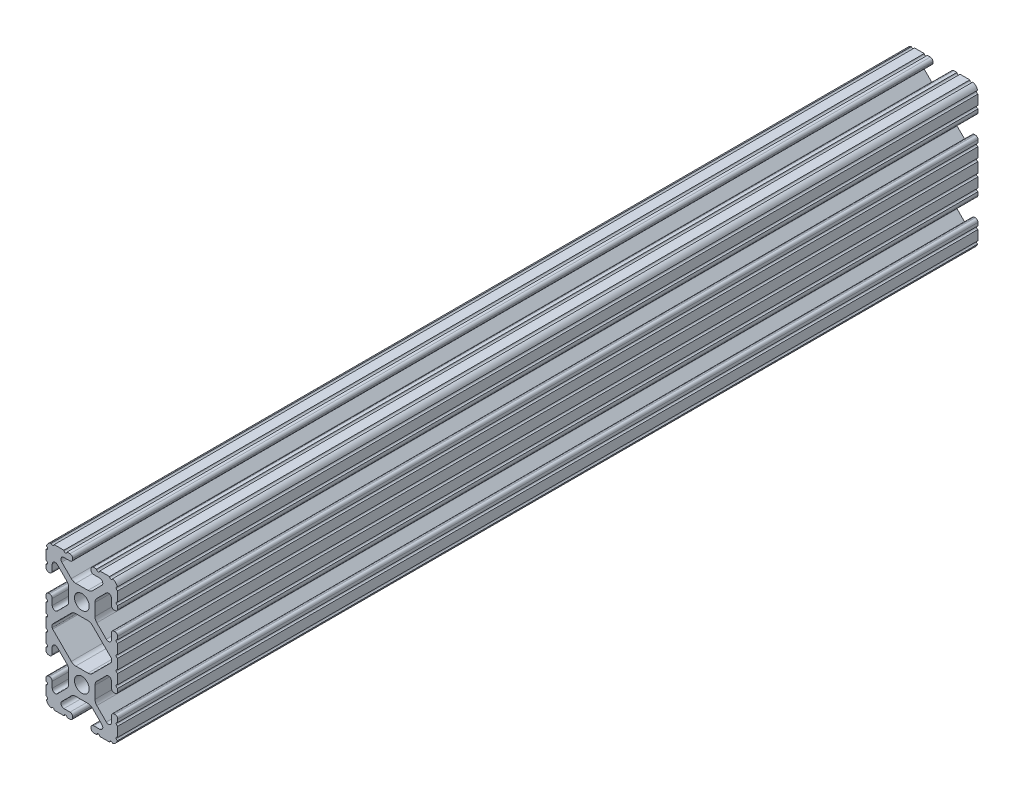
from build123d import *

# Parameters (mm, degrees)
BOSS_EXTRUDE1_DEPTH     = 152.4
CUT_EXTRUDE1_DEPTH      = 156.02325632
CUT_EXTRUDE1_DEPTH_BACK = 156.02325632
SKETCH5_R               = 0.55245
BOSS_EXTRUDE2_DEPTH     = 152.4
CUT_EXTRUDE2_DEPTH      = 156.02325632
CUT_EXTRUDE2_DEPTH_BACK = 156.02325632


with BuildPart() as part:
    # Sketch4 → Boss-Extrude1 (new, symmetric)
    with BuildSketch(Plane.XY):
        with BuildLine():
            Line((4.190365, -25.4), (10.11729625, -25.4))
            ThreePointArc((10.11729625, -25.4), (11.943543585, -24.643543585), (12.7, -22.81729625))
            Line((12.7, -22.81729625), (12.7, -16.890365))
            ThreePointArc((12.7, -16.890365), (12.42492494, -16.22627506), (11.760835, -15.9512))
            Line((11.760835, -15.9512), (11.429365, -15.9512))
            ThreePointArc((11.429365, -15.9512), (10.76527506, -16.22627506), (10.4902, -16.890365))
            Line((10.4902, -16.890365), (10.4902, -19.048478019))
            ThreePointArc((10.4902, -19.048478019), (9.830707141, -20.035478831), (8.666460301, -19.803895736))
            Line((8.666460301, -19.803895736), (5.299899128, -16.437334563))
            ThreePointArc((5.299899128, -16.437334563), (4.817571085, -15.715479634), (4.6482, -14.86399369))
            Line((4.6482, -14.86399369), (4.6482, -12.7))
            Line((4.6482, -12.7), (2.6035, -12.7))
            ThreePointArc((2.6035, -12.7), (1.840952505, -14.540952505), (0, -15.3035))
            Line((0, -15.3035), (0, -17.3482))
            Line((0, -17.3482), (2.16399369, -17.3482))
            ThreePointArc((2.16399369, -17.3482), (3.015479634, -17.517571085), (3.737334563, -17.999899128))
            Line((3.737334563, -17.999899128), (7.103895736, -21.366460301))
            ThreePointArc((7.103895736, -21.366460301), (7.335478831, -22.530707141), (6.348478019, -23.1902))
            Line((6.348478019, -23.1902), (4.190365, -23.1902))
            ThreePointArc((4.190365, -23.1902), (3.52627506, -23.46527506), (3.2512, -24.129365))
            Line((3.2512, -24.129365), (3.2512, -24.460835))
            ThreePointArc((3.2512, -24.460835), (3.52627506, -25.12492494), (4.190365, -25.4))
        make_face()
    extrude(amount=BOSS_EXTRUDE1_DEPTH, both=True)

    # Sketch5 → Cut-Extrude1 (cut, two sides: drawn at the far end of the back side and taken through both)
    with BuildSketch(Plane.XY.offset(-CUT_EXTRUDE1_DEPTH_BACK)):
        with Locations((10.356153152, -25.4)):
            Circle(SKETCH5_R)
        with Locations((5.796028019, -25.4)):
            Circle(SKETCH5_R)
        with Locations((12.7, -23.056153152)):
            Circle(SKETCH5_R)
        with Locations((12.7, -18.496028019)):
            Circle(SKETCH5_R)
    extrude(amount=CUT_EXTRUDE1_DEPTH + CUT_EXTRUDE1_DEPTH_BACK, mode=Mode.SUBTRACT)

    # Mirror1: part across plane


with BuildPart() as part_1:
    add(part.part)
    add(part.part.mirror(Plane(origin=(4.6482, -12.7, 152.4), x_dir=(0, 0, 1), z_dir=(0, -1, 0))))

    # Sketch6 → Boss-Extrude2 (add, symmetric)
    with BuildSketch(Plane.XY):
        with BuildLine():
            Line((12.7, -1.791396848), (12.7, 0))
            Line((12.7, 0), (9.803703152, 0))
            Line((9.803703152, 0), (9.803703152, -2.343846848))
            Line((9.803703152, -2.343846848), (12.14755, -2.343846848))
            ThreePointArc((12.14755, -2.343846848), (12.309358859, -1.953205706), (12.7, -1.791396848))
        make_face()
    extrude(amount=BOSS_EXTRUDE2_DEPTH, both=True)

    # Sketch7 → Cut-Extrude2 (cut, two sides: drawn at the far end of the back side and taken through both)
    with BuildSketch(Plane.XY.offset(-CUT_EXTRUDE2_DEPTH_BACK)):
        with BuildLine():
            Line((5.420615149, -5.716820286), (10.328391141, -0.809044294))
            ThreePointArc((10.328391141, -0.809044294), (10.448147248, -0.629816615), (10.4902, -0.418403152))
            Line((10.4902, -0.418403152), (10.4902, 0))
            Line((10.4902, 0), (0, 0))
            Line((0, 0), (5.420615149, -5.716820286))
        make_face()
    extrude(amount=CUT_EXTRUDE2_DEPTH + CUT_EXTRUDE2_DEPTH_BACK, mode=Mode.SUBTRACT)

    # Mirror2: part across plane


with BuildPart() as part_2:
    add(part_1.part)
    add(part_1.part.mirror(Plane.ZX))

    # Mirror3: part across plane


with BuildPart() as part_3:
    add(part_2.part)
    add(part_2.part.mirror(Plane(origin=(0, 0, 0), x_dir=(0, 0, 1), z_dir=(1, 0, 0))))


solid = part_3.part
